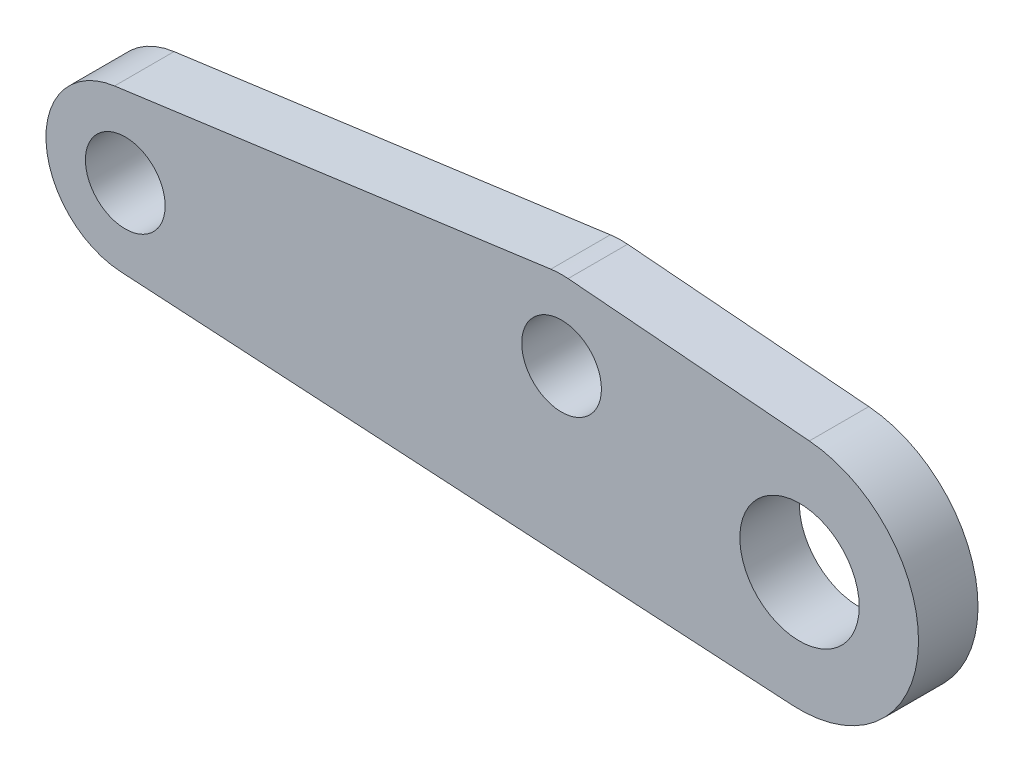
from build123d import *

# Parameters (mm, degrees)
ESQUISSE1_R      = 10.05
ESQUISSE1_R_2    = 15.05
EXTRUSION1_DEPTH = 15


with BuildPart() as part:
    # Esquisse1 → Extrusion1 (new body)
    with BuildSketch(Plane.XY):
        with BuildLine():
            Line((-1.176470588, -19.965367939), (168.235294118, -29.948051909))
            ThreePointArc((168.235294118, -29.948051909), (199.925019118, -2.119724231), (172.47444448, 29.897777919))
            Line((172.47444448, 29.897777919), (111.649629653, 34.931851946))
            ThreePointArc((111.649629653, 34.931851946), (109.470537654, 34.992990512), (107.297735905, 34.816603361))
            Line((107.297735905, 34.816603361), (-2.702264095, 19.816603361))
            ThreePointArc((-2.702264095, 19.816603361), (-19.985305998, -0.766514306), (-1.176470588, -19.965367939))
        make_face()
        Circle(ESQUISSE1_R, mode=Mode.SUBTRACT)
        with Locations((170, 0)):
            Circle(ESQUISSE1_R_2, mode=Mode.SUBTRACT)
        with Locations((110, 15)):
            Circle(ESQUISSE1_R, mode=Mode.SUBTRACT)
    extrude(amount=EXTRUSION1_DEPTH)


solid = part.part
